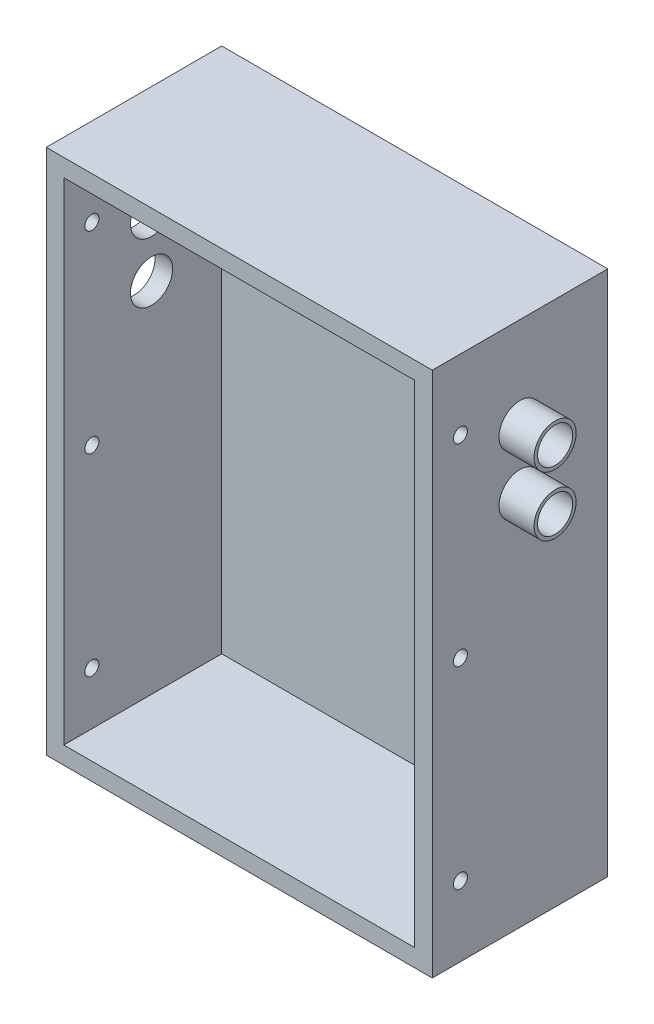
ISO-10303-21;
HEADER;
FILE_DESCRIPTION(('STEP AP214'),'2;1');
FILE_NAME('part.step','',(''),(''),'','','');
FILE_SCHEMA(('AUTOMOTIVE_DESIGN { 1 0 10303 214 1 1 1 1 }'));
ENDSEC;
DATA;
#1=APPLICATION_CONTEXT('core data for automotive mechanical design processes');
#2=APPLICATION_PROTOCOL_DEFINITION('international standard','automotive_design',2000,#1);
#3=PRODUCT_CONTEXT('',#1,'mechanical');
#4=PRODUCT('Part','Part','',(#3));
#5=PRODUCT_RELATED_PRODUCT_CATEGORY('part','',(#4));
#6=PRODUCT_DEFINITION_FORMATION('','',#4);
#7=PRODUCT_DEFINITION_CONTEXT('part definition',#1,'design');
#8=PRODUCT_DEFINITION('design','',#6,#7);
#9=PRODUCT_DEFINITION_SHAPE('','',#8);
#10=(LENGTH_UNIT() NAMED_UNIT(*) SI_UNIT(.MILLI.,.METRE.));
#11=(NAMED_UNIT(*) PLANE_ANGLE_UNIT() SI_UNIT($,.RADIAN.));
#12=(NAMED_UNIT(*) SI_UNIT($,.STERADIAN.) SOLID_ANGLE_UNIT());
#13=UNCERTAINTY_MEASURE_WITH_UNIT(LENGTH_MEASURE(1.E-05),#10,'distance_accuracy_value','');
#14=(GEOMETRIC_REPRESENTATION_CONTEXT(3) GLOBAL_UNCERTAINTY_ASSIGNED_CONTEXT((#13)) GLOBAL_UNIT_ASSIGNED_CONTEXT((#10,
#11,#12)) REPRESENTATION_CONTEXT('',''));
#15=CARTESIAN_POINT('',(0.,0.,0.));
#16=DIRECTION('',(0.,0.,1.));
#17=DIRECTION('',(1.,0.,0.));
#18=AXIS2_PLACEMENT_3D('',#15,#16,#17);
#19=CARTESIAN_POINT('',(-65.000012,32.,25.));
#20=DIRECTION('',(1.,0.,0.));
#21=DIRECTION('',(0.,1.,0.));
#22=AXIS2_PLACEMENT_3D('',#19,#20,#21);
#23=CYLINDRICAL_SURFACE('',#22,5.);
#24=CARTESIAN_POINT('',(64.9999999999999,32.0000000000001,25.));
#25=DIRECTION('',(-1.,0.,0.));
#26=DIRECTION('',(0.,-1.,0.));
#27=AXIS2_PLACEMENT_3D('',#24,#25,#26);
#28=CIRCLE('',#27,5.);
#29=CARTESIAN_POINT('',(64.9999999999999,37.0000000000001,25.));
#30=VERTEX_POINT('',#29);
#31=EDGE_CURVE('E215',#30,#30,#28,.F.);
#32=CARTESIAN_POINT('',(50.,32.0000000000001,25.));
#33=DIRECTION('',(-1.,0.,0.));
#34=DIRECTION('',(0.,-1.,0.));
#35=AXIS2_PLACEMENT_3D('',#32,#33,#34);
#36=CIRCLE('',#35,5.);
#37=CARTESIAN_POINT('',(50.,37.0000000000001,25.));
#38=VERTEX_POINT('',#37);
#39=EDGE_CURVE('E176',#38,#38,#36,.T.);
#40=CARTESIAN_POINT('',(64.9999999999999,37.0000000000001,25.));
#41=CARTESIAN_POINT('',(64.8437499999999,37.0000000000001,25.));
#42=CARTESIAN_POINT('',(64.6875,37.0000000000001,25.));
#43=CARTESIAN_POINT('',(64.3749999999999,37.0000000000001,25.));
#44=CARTESIAN_POINT('',(64.2187499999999,37.0000000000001,25.));
#45=CARTESIAN_POINT('',(63.9062499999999,37.0000000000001,25.));
#46=CARTESIAN_POINT('',(63.7499999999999,37.0000000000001,25.));
#47=CARTESIAN_POINT('',(63.4375,37.0000000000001,25.));
#48=CARTESIAN_POINT('',(63.28125,37.0000000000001,25.));
#49=CARTESIAN_POINT('',(62.96875,37.0000000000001,25.));
#50=CARTESIAN_POINT('',(62.8125,37.0000000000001,25.));
#51=CARTESIAN_POINT('',(62.4999999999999,37.0000000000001,25.));
#52=CARTESIAN_POINT('',(62.34375,37.0000000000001,25.));
#53=CARTESIAN_POINT('',(62.03125,37.0000000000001,25.));
#54=CARTESIAN_POINT('',(61.875,37.0000000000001,25.));
#55=CARTESIAN_POINT('',(61.5625,37.0000000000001,25.));
#56=CARTESIAN_POINT('',(61.40625,37.0000000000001,25.));
#57=CARTESIAN_POINT('',(61.0937499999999,37.0000000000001,25.));
#58=CARTESIAN_POINT('',(60.9375,37.0000000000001,25.));
#59=CARTESIAN_POINT('',(60.625,37.0000000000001,25.));
#60=CARTESIAN_POINT('',(60.46875,37.0000000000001,25.));
#61=CARTESIAN_POINT('',(60.15625,37.0000000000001,25.));
#62=CARTESIAN_POINT('',(60.,37.0000000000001,25.));
#63=CARTESIAN_POINT('',(59.6875,37.0000000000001,25.));
#64=CARTESIAN_POINT('',(59.53125,37.0000000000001,25.));
#65=CARTESIAN_POINT('',(59.21875,37.0000000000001,25.));
#66=CARTESIAN_POINT('',(59.0625,37.0000000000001,25.));
#67=CARTESIAN_POINT('',(58.75,37.0000000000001,25.));
#68=CARTESIAN_POINT('',(58.59375,37.0000000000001,25.));
#69=CARTESIAN_POINT('',(58.28125,37.0000000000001,25.));
#70=CARTESIAN_POINT('',(58.125,37.0000000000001,25.));
#71=CARTESIAN_POINT('',(57.8125,37.0000000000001,25.));
#72=CARTESIAN_POINT('',(57.65625,37.0000000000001,25.));
#73=CARTESIAN_POINT('',(57.34375,37.0000000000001,25.));
#74=CARTESIAN_POINT('',(57.1875,37.0000000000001,25.));
#75=CARTESIAN_POINT('',(56.875,37.0000000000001,25.));
#76=CARTESIAN_POINT('',(56.71875,37.0000000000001,25.));
#77=CARTESIAN_POINT('',(56.40625,37.0000000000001,25.));
#78=CARTESIAN_POINT('',(56.25,37.0000000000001,25.));
#79=CARTESIAN_POINT('',(55.9375,37.0000000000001,25.));
#80=CARTESIAN_POINT('',(55.78125,37.0000000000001,25.));
#81=CARTESIAN_POINT('',(55.46875,37.0000000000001,25.));
#82=CARTESIAN_POINT('',(55.3125,37.0000000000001,25.));
#83=CARTESIAN_POINT('',(55.,37.0000000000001,25.));
#84=CARTESIAN_POINT('',(54.84375,37.0000000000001,25.));
#85=CARTESIAN_POINT('',(54.53125,37.0000000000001,25.));
#86=CARTESIAN_POINT('',(54.375,37.0000000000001,25.));
#87=CARTESIAN_POINT('',(54.0625,37.0000000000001,25.));
#88=CARTESIAN_POINT('',(53.90625,37.0000000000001,25.));
#89=CARTESIAN_POINT('',(53.59375,37.0000000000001,25.));
#90=CARTESIAN_POINT('',(53.4375,37.0000000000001,25.));
#91=CARTESIAN_POINT('',(53.125,37.0000000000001,25.));
#92=CARTESIAN_POINT('',(52.96875,37.0000000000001,25.));
#93=CARTESIAN_POINT('',(52.65625,37.0000000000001,25.));
#94=CARTESIAN_POINT('',(52.5,37.0000000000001,25.));
#95=CARTESIAN_POINT('',(52.1875,37.0000000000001,25.));
#96=CARTESIAN_POINT('',(52.03125,37.0000000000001,25.));
#97=CARTESIAN_POINT('',(51.71875,37.0000000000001,25.));
#98=CARTESIAN_POINT('',(51.5625,37.0000000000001,25.));
#99=CARTESIAN_POINT('',(51.25,37.0000000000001,25.));
#100=CARTESIAN_POINT('',(51.09375,37.0000000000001,25.));
#101=CARTESIAN_POINT('',(50.78125,37.0000000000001,25.));
#102=CARTESIAN_POINT('',(50.625,37.0000000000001,25.));
#103=CARTESIAN_POINT('',(50.3125,37.0000000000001,25.));
#104=CARTESIAN_POINT('',(50.15625,37.0000000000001,25.));
#105=CARTESIAN_POINT('',(50.,37.0000000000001,25.));
#106=B_SPLINE_CURVE_WITH_KNOTS('',3,(#40,#41,#42,#43,#44,#45,#46,#47,#48,#49,#50,#51,#52,#53,
#54,#55,#56,#57,#58,#59,#60,#61,#62,#63,#64,#65,#66,#67,#68,#69,#70,#71,#72,#73,#74,#75,#76,#77,
#78,#79,#80,#81,#82,#83,#84,#85,#86,#87,#88,#89,#90,#91,#92,#93,#94,#95,#96,#97,#98,#99,#100,
#101,#102,#103,#104,#105),.UNSPECIFIED.,.F.,.F.,(4,2,2,2,2,2,2,2,2,2,2,2,2,2,2,2,2,2,2,2,2,2,2,
2,2,2,2,2,2,2,2,2,4),(0.,0.46874999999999,0.937500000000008,1.40625,1.87499999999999,
2.34375000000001,2.8125,3.28124999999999,3.75,4.21874999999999,4.68749999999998,
5.15624999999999,5.62499999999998,6.09374999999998,6.56249999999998,7.03124999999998,
7.49999999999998,7.96874999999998,8.43749999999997,8.90624999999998,9.37499999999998,
9.84374999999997,10.3125,10.78125,11.25,11.71875,12.1875,12.65625,13.125,13.59375,14.0625,
14.53125,15.),.UNSPECIFIED.);
#107=EDGE_CURVE('BSEAM39',#30,#38,#106,.T.);
#108=ORIENTED_EDGE('',*,*,#31,.T.);
#109=ORIENTED_EDGE('',*,*,#39,.T.);
#110=ORIENTED_EDGE('',*,*,#107,.T.);
#111=ORIENTED_EDGE('',*,*,#107,.F.);
#112=EDGE_LOOP('',(#108,#110,#109,#111));
#113=FACE_BOUND('',#112,.T.);
#114=ADVANCED_FACE('F39',(#113),#23,.F.);
#115=CARTESIAN_POINT('',(-65.000012,49.,25.));
#116=DIRECTION('',(1.,0.,0.));
#117=DIRECTION('',(0.,1.,0.));
#118=AXIS2_PLACEMENT_3D('',#115,#116,#117);
#119=CYLINDRICAL_SURFACE('',#118,5.);
#120=CARTESIAN_POINT('',(64.9999999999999,49.,25.));
#121=DIRECTION('',(-1.,0.,0.));
#122=DIRECTION('',(0.,-1.,0.));
#123=AXIS2_PLACEMENT_3D('',#120,#121,#122);
#124=CIRCLE('',#123,5.);
#125=CARTESIAN_POINT('',(64.9999999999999,54.,25.));
#126=VERTEX_POINT('',#125);
#127=EDGE_CURVE('E216',#126,#126,#124,.F.);
#128=CARTESIAN_POINT('',(50.,49.,25.));
#129=DIRECTION('',(-1.,0.,0.));
#130=DIRECTION('',(0.,-1.,0.));
#131=AXIS2_PLACEMENT_3D('',#128,#129,#130);
#132=CIRCLE('',#131,5.);
#133=CARTESIAN_POINT('',(50.,54.,25.));
#134=VERTEX_POINT('',#133);
#135=EDGE_CURVE('E171',#134,#134,#132,.T.);
#136=CARTESIAN_POINT('',(64.9999999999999,54.,25.));
#137=CARTESIAN_POINT('',(64.8437499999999,54.,25.));
#138=CARTESIAN_POINT('',(64.6874999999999,54.,25.));
#139=CARTESIAN_POINT('',(64.3749999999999,54.,25.));
#140=CARTESIAN_POINT('',(64.2187499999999,54.,25.));
#141=CARTESIAN_POINT('',(63.9062499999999,54.,25.));
#142=CARTESIAN_POINT('',(63.7499999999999,54.,25.));
#143=CARTESIAN_POINT('',(63.4374999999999,54.,25.));
#144=CARTESIAN_POINT('',(63.2812499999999,54.,25.));
#145=CARTESIAN_POINT('',(62.9687499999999,54.,25.));
#146=CARTESIAN_POINT('',(62.8124999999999,54.,25.));
#147=CARTESIAN_POINT('',(62.4999999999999,54.,25.));
#148=CARTESIAN_POINT('',(62.3437499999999,54.,25.));
#149=CARTESIAN_POINT('',(62.0312499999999,54.,25.));
#150=CARTESIAN_POINT('',(61.8749999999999,54.,25.));
#151=CARTESIAN_POINT('',(61.5625,54.,25.));
#152=CARTESIAN_POINT('',(61.40625,54.,25.));
#153=CARTESIAN_POINT('',(61.09375,54.,25.));
#154=CARTESIAN_POINT('',(60.9374999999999,54.,25.));
#155=CARTESIAN_POINT('',(60.6249999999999,54.,25.));
#156=CARTESIAN_POINT('',(60.4687499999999,54.,25.));
#157=CARTESIAN_POINT('',(60.15625,54.,25.));
#158=CARTESIAN_POINT('',(60.,54.,25.));
#159=CARTESIAN_POINT('',(59.6875,54.,25.));
#160=CARTESIAN_POINT('',(59.53125,54.,25.));
#161=CARTESIAN_POINT('',(59.21875,54.,25.));
#162=CARTESIAN_POINT('',(59.0625,54.,25.));
#163=CARTESIAN_POINT('',(58.75,54.,25.));
#164=CARTESIAN_POINT('',(58.59375,54.,25.));
#165=CARTESIAN_POINT('',(58.28125,54.,25.));
#166=CARTESIAN_POINT('',(58.125,54.,25.));
#167=CARTESIAN_POINT('',(57.8125,54.,25.));
#168=CARTESIAN_POINT('',(57.65625,54.,25.));
#169=CARTESIAN_POINT('',(57.34375,54.,25.));
#170=CARTESIAN_POINT('',(57.1875,54.,25.));
#171=CARTESIAN_POINT('',(56.875,54.,25.));
#172=CARTESIAN_POINT('',(56.71875,54.,25.));
#173=CARTESIAN_POINT('',(56.40625,54.,25.));
#174=CARTESIAN_POINT('',(56.25,54.,25.));
#175=CARTESIAN_POINT('',(55.9375,54.,25.));
#176=CARTESIAN_POINT('',(55.78125,54.,25.));
#177=CARTESIAN_POINT('',(55.46875,54.,25.));
#178=CARTESIAN_POINT('',(55.3125,54.,25.));
#179=CARTESIAN_POINT('',(55.,54.,25.));
#180=CARTESIAN_POINT('',(54.84375,54.,25.));
#181=CARTESIAN_POINT('',(54.53125,54.,25.));
#182=CARTESIAN_POINT('',(54.375,54.,25.));
#183=CARTESIAN_POINT('',(54.0625,54.,25.));
#184=CARTESIAN_POINT('',(53.90625,54.,25.));
#185=CARTESIAN_POINT('',(53.59375,54.,25.));
#186=CARTESIAN_POINT('',(53.4375,54.,25.));
#187=CARTESIAN_POINT('',(53.125,54.,25.));
#188=CARTESIAN_POINT('',(52.96875,54.,25.));
#189=CARTESIAN_POINT('',(52.65625,54.,25.));
#190=CARTESIAN_POINT('',(52.5,54.,25.));
#191=CARTESIAN_POINT('',(52.1875,54.,25.));
#192=CARTESIAN_POINT('',(52.03125,54.,25.));
#193=CARTESIAN_POINT('',(51.71875,54.,25.));
#194=CARTESIAN_POINT('',(51.5625,54.,25.));
#195=CARTESIAN_POINT('',(51.25,54.,25.));
#196=CARTESIAN_POINT('',(51.09375,54.,25.));
#197=CARTESIAN_POINT('',(50.78125,54.,25.));
#198=CARTESIAN_POINT('',(50.625,54.,25.));
#199=CARTESIAN_POINT('',(50.3125,54.,25.));
#200=CARTESIAN_POINT('',(50.15625,54.,25.));
#201=CARTESIAN_POINT('',(50.,54.,25.));
#202=B_SPLINE_CURVE_WITH_KNOTS('',3,(#136,#137,#138,#139,#140,#141,#142,#143,#144,#145,#146,
#147,#148,#149,#150,#151,#152,#153,#154,#155,#156,#157,#158,#159,#160,#161,#162,#163,#164,#165,
#166,#167,#168,#169,#170,#171,#172,#173,#174,#175,#176,#177,#178,#179,#180,#181,#182,#183,#184,
#185,#186,#187,#188,#189,#190,#191,#192,#193,#194,#195,#196,#197,#198,#199,#200,#201),
.UNSPECIFIED.,.F.,.F.,(4,2,2,2,2,2,2,2,2,2,2,2,2,2,2,2,2,2,2,2,2,2,2,2,2,2,2,2,2,2,2,2,4),(0.,
0.46874999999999,0.937500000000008,1.40625,1.87499999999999,2.34375000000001,2.8125,
3.28124999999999,3.74999999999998,4.21874999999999,4.68749999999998,5.15624999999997,
5.62499999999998,6.09374999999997,6.56249999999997,7.03124999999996,7.49999999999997,
7.96874999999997,8.43749999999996,8.90624999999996,9.37499999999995,9.84374999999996,10.3125,
10.78125,11.25,11.71875,12.1874999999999,12.65625,13.125,13.5937499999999,14.0625,
14.5312499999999,14.9999999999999),.UNSPECIFIED.);
#203=EDGE_CURVE('BSEAM323',#126,#134,#202,.T.);
#204=ORIENTED_EDGE('',*,*,#127,.T.);
#205=ORIENTED_EDGE('',*,*,#135,.T.);
#206=ORIENTED_EDGE('',*,*,#203,.T.);
#207=ORIENTED_EDGE('',*,*,#203,.F.);
#208=EDGE_LOOP('',(#204,#206,#205,#207));
#209=FACE_BOUND('',#208,.T.);
#210=ADVANCED_FACE('F323',(#209),#119,.F.);
#211=CARTESIAN_POINT('',(55.,75.,50.));
#212=DIRECTION('',(-1.,0.,0.));
#213=DIRECTION('',(0.,0.,1.));
#214=AXIS2_PLACEMENT_3D('',#211,#212,#213);
#215=PLANE('',#214);
#216=CARTESIAN_POINT('',(55.,55.,42.));
#217=DIRECTION('',(-1.,0.,0.));
#218=DIRECTION('',(0.,0.,1.));
#219=AXIS2_PLACEMENT_3D('',#216,#217,#218);
#220=CIRCLE('',#219,2.);
#221=CARTESIAN_POINT('',(55.,55.,44.));
#222=VERTEX_POINT('',#221);
#223=EDGE_CURVE('E211',#222,#222,#220,.T.);
#224=ORIENTED_EDGE('',*,*,#223,.T.);
#225=EDGE_LOOP('',(#224));
#226=FACE_BOUND('',#225,.T.);
#227=CARTESIAN_POINT('',(55.,0.,42.));
#228=DIRECTION('',(-1.,0.,0.));
#229=DIRECTION('',(0.,0.,1.));
#230=AXIS2_PLACEMENT_3D('',#227,#228,#229);
#231=CIRCLE('',#230,2.);
#232=CARTESIAN_POINT('',(55.,0.,44.));
#233=VERTEX_POINT('',#232);
#234=EDGE_CURVE('E200',#233,#233,#231,.T.);
#235=ORIENTED_EDGE('',*,*,#234,.T.);
#236=EDGE_LOOP('',(#235));
#237=FACE_BOUND('',#236,.T.);
#238=CARTESIAN_POINT('',(55.,-55.,42.));
#239=DIRECTION('',(-1.,0.,0.));
#240=DIRECTION('',(0.,0.,1.));
#241=AXIS2_PLACEMENT_3D('',#238,#239,#240);
#242=CIRCLE('',#241,2.);
#243=CARTESIAN_POINT('',(55.,-55.,44.));
#244=VERTEX_POINT('',#243);
#245=EDGE_CURVE('E188',#244,#244,#242,.T.);
#246=ORIENTED_EDGE('',*,*,#245,.T.);
#247=EDGE_LOOP('',(#246));
#248=FACE_BOUND('',#247,.T.);
#249=CARTESIAN_POINT('',(55.,32.0000000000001,25.));
#250=DIRECTION('',(-1.,0.,0.));
#251=DIRECTION('',(0.,0.,1.));
#252=AXIS2_PLACEMENT_3D('',#249,#250,#251);
#253=CIRCLE('',#252,6.);
#254=CARTESIAN_POINT('',(55.,32.0000000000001,31.));
#255=VERTEX_POINT('',#254);
#256=EDGE_CURVE('E227',#255,#255,#253,.T.);
#257=ORIENTED_EDGE('',*,*,#256,.T.);
#258=EDGE_LOOP('',(#257));
#259=FACE_BOUND('',#258,.T.);
#260=CARTESIAN_POINT('',(55.,49.,25.));
#261=DIRECTION('',(-1.,0.,0.));
#262=DIRECTION('',(0.,0.,1.));
#263=AXIS2_PLACEMENT_3D('',#260,#261,#262);
#264=CIRCLE('',#263,6.);
#265=CARTESIAN_POINT('',(55.,49.,31.));
#266=VERTEX_POINT('',#265);
#267=EDGE_CURVE('E235',#266,#266,#264,.T.);
#268=ORIENTED_EDGE('',*,*,#267,.T.);
#269=EDGE_LOOP('',(#268));
#270=FACE_BOUND('',#269,.T.);
#271=DIRECTION('',(0.,1.,0.));
#272=VECTOR('',#271,1.);
#273=CARTESIAN_POINT('',(55.,75.,0.));
#274=LINE('',#273,#272);
#275=CARTESIAN_POINT('',(55.,-75.,0.));
#276=VERTEX_POINT('',#275);
#277=CARTESIAN_POINT('',(55.,75.,0.));
#278=VERTEX_POINT('',#277);
#279=EDGE_CURVE('E239',#276,#278,#274,.T.);
#280=ORIENTED_EDGE('',*,*,#279,.T.);
#281=DIRECTION('',(0.,0.,-1.));
#282=VECTOR('',#281,1.);
#283=CARTESIAN_POINT('',(55.,75.,50.));
#284=LINE('',#283,#282);
#285=CARTESIAN_POINT('',(55.,75.,50.));
#286=VERTEX_POINT('',#285);
#287=EDGE_CURVE('E11',#286,#278,#284,.T.);
#288=ORIENTED_EDGE('',*,*,#287,.F.);
#289=DIRECTION('',(0.,1.,0.));
#290=VECTOR('',#289,1.);
#291=CARTESIAN_POINT('',(55.,75.,50.));
#292=LINE('',#291,#290);
#293=CARTESIAN_POINT('',(55.,-75.,50.));
#294=VERTEX_POINT('',#293);
#295=EDGE_CURVE('E240',#294,#286,#292,.T.);
#296=ORIENTED_EDGE('',*,*,#295,.F.);
#297=DIRECTION('',(0.,0.,-1.));
#298=VECTOR('',#297,1.);
#299=CARTESIAN_POINT('',(55.,-75.,50.));
#300=LINE('',#299,#298);
#301=EDGE_CURVE('E250',#294,#276,#300,.T.);
#302=ORIENTED_EDGE('',*,*,#301,.T.);
#303=EDGE_LOOP('',(#280,#288,#296,#302));
#304=FACE_BOUND('',#303,.T.);
#305=ADVANCED_FACE('F41',(#226,#237,#248,#259,#270,#304),#215,.F.);
#306=CARTESIAN_POINT('',(-55.,75.,50.));
#307=DIRECTION('',(0.,-1.,0.));
#308=DIRECTION('',(0.,0.,-1.));
#309=AXIS2_PLACEMENT_3D('',#306,#307,#308);
#310=PLANE('',#309);
#311=DIRECTION('',(0.,0.,-1.));
#312=VECTOR('',#311,1.);
#313=CARTESIAN_POINT('',(-55.,75.,50.));
#314=LINE('',#313,#312);
#315=CARTESIAN_POINT('',(-55.,75.,50.));
#316=VERTEX_POINT('',#315);
#317=CARTESIAN_POINT('',(-55.,75.,0.));
#318=VERTEX_POINT('',#317);
#319=EDGE_CURVE('E49',#316,#318,#314,.T.);
#320=ORIENTED_EDGE('',*,*,#319,.F.);
#321=DIRECTION('',(-1.,0.,0.));
#322=VECTOR('',#321,1.);
#323=CARTESIAN_POINT('',(-55.,75.,50.));
#324=LINE('',#323,#322);
#325=EDGE_CURVE('E94',#286,#316,#324,.T.);
#326=ORIENTED_EDGE('',*,*,#325,.F.);
#327=ORIENTED_EDGE('',*,*,#287,.T.);
#328=DIRECTION('',(-1.,0.,0.));
#329=VECTOR('',#328,1.);
#330=CARTESIAN_POINT('',(-55.,75.,0.));
#331=LINE('',#330,#329);
#332=EDGE_CURVE('E254',#278,#318,#331,.T.);
#333=ORIENTED_EDGE('',*,*,#332,.T.);
#334=EDGE_LOOP('',(#320,#326,#327,#333));
#335=FACE_BOUND('',#334,.T.);
#336=ADVANCED_FACE('F296',(#335),#310,.F.);
#337=CARTESIAN_POINT('',(-55.,75.,50.));
#338=DIRECTION('',(1.,0.,0.));
#339=DIRECTION('',(0.,1.,0.));
#340=AXIS2_PLACEMENT_3D('',#337,#338,#339);
#341=PLANE('',#340);
#342=CARTESIAN_POINT('',(-55.,55.,42.));
#343=DIRECTION('',(1.,0.,0.));
#344=DIRECTION('',(0.,1.,0.));
#345=AXIS2_PLACEMENT_3D('',#342,#343,#344);
#346=CIRCLE('',#345,2.);
#347=CARTESIAN_POINT('',(-55.,57.,42.));
#348=VERTEX_POINT('',#347);
#349=EDGE_CURVE('E204',#348,#348,#346,.T.);
#350=ORIENTED_EDGE('',*,*,#349,.T.);
#351=EDGE_LOOP('',(#350));
#352=FACE_BOUND('',#351,.T.);
#353=CARTESIAN_POINT('',(-55.,0.,42.));
#354=DIRECTION('',(1.,0.,0.));
#355=DIRECTION('',(0.,1.,0.));
#356=AXIS2_PLACEMENT_3D('',#353,#354,#355);
#357=CIRCLE('',#356,2.);
#358=CARTESIAN_POINT('',(-55.,2.00000000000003,42.));
#359=VERTEX_POINT('',#358);
#360=EDGE_CURVE('E193',#359,#359,#357,.T.);
#361=ORIENTED_EDGE('',*,*,#360,.T.);
#362=EDGE_LOOP('',(#361));
#363=FACE_BOUND('',#362,.T.);
#364=CARTESIAN_POINT('',(-55.,-55.,42.));
#365=DIRECTION('',(1.,0.,0.));
#366=DIRECTION('',(0.,1.,0.));
#367=AXIS2_PLACEMENT_3D('',#364,#365,#366);
#368=CIRCLE('',#367,2.);
#369=CARTESIAN_POINT('',(-55.,-53.,42.));
#370=VERTEX_POINT('',#369);
#371=EDGE_CURVE('E184',#370,#370,#368,.T.);
#372=ORIENTED_EDGE('',*,*,#371,.T.);
#373=EDGE_LOOP('',(#372));
#374=FACE_BOUND('',#373,.T.);
#375=CARTESIAN_POINT('',(-55.,32.,25.));
#376=DIRECTION('',(1.,0.,0.));
#377=DIRECTION('',(0.,1.,0.));
#378=AXIS2_PLACEMENT_3D('',#375,#376,#377);
#379=CIRCLE('',#378,6.);
#380=CARTESIAN_POINT('',(-55.,38.,25.));
#381=VERTEX_POINT('',#380);
#382=EDGE_CURVE('E305',#381,#381,#379,.T.);
#383=ORIENTED_EDGE('',*,*,#382,.T.);
#384=EDGE_LOOP('',(#383));
#385=FACE_BOUND('',#384,.T.);
#386=CARTESIAN_POINT('',(-55.,49.,25.));
#387=DIRECTION('',(1.,0.,0.));
#388=DIRECTION('',(0.,1.,0.));
#389=AXIS2_PLACEMENT_3D('',#386,#387,#388);
#390=CIRCLE('',#389,6.);
#391=CARTESIAN_POINT('',(-55.,55.,25.));
#392=VERTEX_POINT('',#391);
#393=EDGE_CURVE('E147',#392,#392,#390,.T.);
#394=ORIENTED_EDGE('',*,*,#393,.T.);
#395=EDGE_LOOP('',(#394));
#396=FACE_BOUND('',#395,.T.);
#397=DIRECTION('',(0.,-1.,0.));
#398=VECTOR('',#397,1.);
#399=CARTESIAN_POINT('',(-55.,75.,0.));
#400=LINE('',#399,#398);
#401=CARTESIAN_POINT('',(-55.,-75.,0.));
#402=VERTEX_POINT('',#401);
#403=EDGE_CURVE('E257',#318,#402,#400,.T.);
#404=ORIENTED_EDGE('',*,*,#403,.T.);
#405=DIRECTION('',(0.,0.,-1.));
#406=VECTOR('',#405,1.);
#407=CARTESIAN_POINT('',(-55.,-75.,50.));
#408=LINE('',#407,#406);
#409=CARTESIAN_POINT('',(-55.,-75.,50.));
#410=VERTEX_POINT('',#409);
#411=EDGE_CURVE('E264',#410,#402,#408,.T.);
#412=ORIENTED_EDGE('',*,*,#411,.F.);
#413=DIRECTION('',(0.,-1.,0.));
#414=VECTOR('',#413,1.);
#415=CARTESIAN_POINT('',(-55.,75.,50.));
#416=LINE('',#415,#414);
#417=EDGE_CURVE('E245',#316,#410,#416,.T.);
#418=ORIENTED_EDGE('',*,*,#417,.F.);
#419=ORIENTED_EDGE('',*,*,#319,.T.);
#420=EDGE_LOOP('',(#404,#412,#418,#419));
#421=FACE_BOUND('',#420,.T.);
#422=ADVANCED_FACE('F292',(#352,#363,#374,#385,#396,#421),#341,.F.);
#423=CARTESIAN_POINT('',(-55.,-75.,50.));
#424=DIRECTION('',(0.,1.,0.));
#425=DIRECTION('',(0.,0.,1.));
#426=AXIS2_PLACEMENT_3D('',#423,#424,#425);
#427=PLANE('',#426);
#428=ORIENTED_EDGE('',*,*,#301,.F.);
#429=DIRECTION('',(1.,0.,0.));
#430=VECTOR('',#429,1.);
#431=CARTESIAN_POINT('',(-55.,-75.,50.));
#432=LINE('',#431,#430);
#433=EDGE_CURVE('E66',#410,#294,#432,.T.);
#434=ORIENTED_EDGE('',*,*,#433,.F.);
#435=ORIENTED_EDGE('',*,*,#411,.T.);
#436=DIRECTION('',(1.,0.,0.));
#437=VECTOR('',#436,1.);
#438=CARTESIAN_POINT('',(-55.,-75.,0.));
#439=LINE('',#438,#437);
#440=EDGE_CURVE('E87',#402,#276,#439,.T.);
#441=ORIENTED_EDGE('',*,*,#440,.T.);
#442=EDGE_LOOP('',(#428,#434,#435,#441));
#443=FACE_BOUND('',#442,.T.);
#444=ADVANCED_FACE('F295',(#443),#427,.F.);
#445=CARTESIAN_POINT('',(0.,0.,50.));
#446=DIRECTION('',(0.,0.,1.));
#447=DIRECTION('',(1.,0.,0.));
#448=AXIS2_PLACEMENT_3D('',#445,#446,#447);
#449=PLANE('',#448);
#450=DIRECTION('',(0.,1.,0.));
#451=VECTOR('',#450,1.);
#452=CARTESIAN_POINT('',(50.,70.,50.));
#453=LINE('',#452,#451);
#454=CARTESIAN_POINT('',(50.,-70.,50.));
#455=VERTEX_POINT('',#454);
#456=CARTESIAN_POINT('',(50.,70.,50.));
#457=VERTEX_POINT('',#456);
#458=EDGE_CURVE('E57',#455,#457,#453,.T.);
#459=ORIENTED_EDGE('',*,*,#458,.F.);
#460=DIRECTION('',(1.,0.,0.));
#461=VECTOR('',#460,1.);
#462=CARTESIAN_POINT('',(-50.,-70.,50.));
#463=LINE('',#462,#461);
#464=CARTESIAN_POINT('',(-50.,-70.,50.));
#465=VERTEX_POINT('',#464);
#466=EDGE_CURVE('E140',#465,#455,#463,.T.);
#467=ORIENTED_EDGE('',*,*,#466,.F.);
#468=DIRECTION('',(0.,-1.,0.));
#469=VECTOR('',#468,1.);
#470=CARTESIAN_POINT('',(-50.,70.,50.));
#471=LINE('',#470,#469);
#472=CARTESIAN_POINT('',(-50.,70.,50.));
#473=VERTEX_POINT('',#472);
#474=EDGE_CURVE('E144',#473,#465,#471,.T.);
#475=ORIENTED_EDGE('',*,*,#474,.F.);
#476=DIRECTION('',(-1.,0.,0.));
#477=VECTOR('',#476,1.);
#478=CARTESIAN_POINT('',(-50.,70.,50.));
#479=LINE('',#478,#477);
#480=EDGE_CURVE('E156',#457,#473,#479,.T.);
#481=ORIENTED_EDGE('',*,*,#480,.F.);
#482=EDGE_LOOP('',(#459,#467,#475,#481));
#483=FACE_BOUND('',#482,.T.);
#484=ORIENTED_EDGE('',*,*,#433,.T.);
#485=ORIENTED_EDGE('',*,*,#295,.T.);
#486=ORIENTED_EDGE('',*,*,#325,.T.);
#487=ORIENTED_EDGE('',*,*,#417,.T.);
#488=EDGE_LOOP('',(#484,#485,#486,#487));
#489=FACE_BOUND('',#488,.T.);
#490=ADVANCED_FACE('F318',(#483,#489),#449,.T.);
#491=CARTESIAN_POINT('',(0.,0.,0.));
#492=DIRECTION('',(0.,0.,1.));
#493=DIRECTION('',(1.,0.,0.));
#494=AXIS2_PLACEMENT_3D('',#491,#492,#493);
#495=PLANE('',#494);
#496=ORIENTED_EDGE('',*,*,#279,.F.);
#497=ORIENTED_EDGE('',*,*,#440,.F.);
#498=ORIENTED_EDGE('',*,*,#403,.F.);
#499=ORIENTED_EDGE('',*,*,#332,.F.);
#500=EDGE_LOOP('',(#496,#497,#498,#499));
#501=FACE_BOUND('',#500,.T.);
#502=ADVANCED_FACE('F314',(#501),#495,.F.);
#503=CARTESIAN_POINT('',(64.9999999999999,49.,25.));
#504=DIRECTION('',(-1.,0.,0.));
#505=DIRECTION('',(0.,-1.,0.));
#506=AXIS2_PLACEMENT_3D('',#503,#504,#505);
#507=CYLINDRICAL_SURFACE('',#506,6.);
#508=CARTESIAN_POINT('',(64.9999999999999,49.,25.));
#509=DIRECTION('',(-1.,0.,0.));
#510=DIRECTION('',(0.,-1.,0.));
#511=AXIS2_PLACEMENT_3D('',#508,#509,#510);
#512=CIRCLE('',#511,6.);
#513=CARTESIAN_POINT('',(64.9999999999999,43.,25.));
#514=VERTEX_POINT('',#513);
#515=EDGE_CURVE('E231',#514,#514,#512,.T.);
#516=ORIENTED_EDGE('',*,*,#515,.T.);
#517=EDGE_LOOP('',(#516));
#518=FACE_BOUND('',#517,.T.);
#519=ORIENTED_EDGE('',*,*,#267,.F.);
#520=EDGE_LOOP('',(#519));
#521=FACE_BOUND('',#520,.T.);
#522=ADVANCED_FACE('F348',(#518,#521),#507,.T.);
#523=CARTESIAN_POINT('',(64.9999999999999,49.,25.));
#524=DIRECTION('',(-1.,0.,0.));
#525=DIRECTION('',(0.,-1.,0.));
#526=AXIS2_PLACEMENT_3D('',#523,#524,#525);
#527=PLANE('',#526);
#528=ORIENTED_EDGE('',*,*,#127,.F.);
#529=EDGE_LOOP('',(#528));
#530=FACE_BOUND('',#529,.T.);
#531=ORIENTED_EDGE('',*,*,#515,.F.);
#532=EDGE_LOOP('',(#531));
#533=FACE_BOUND('',#532,.T.);
#534=ADVANCED_FACE('F344',(#530,#533),#527,.F.);
#535=CARTESIAN_POINT('',(64.9999999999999,32.0000000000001,25.));
#536=DIRECTION('',(-1.,0.,0.));
#537=DIRECTION('',(0.,-1.,0.));
#538=AXIS2_PLACEMENT_3D('',#535,#536,#537);
#539=CYLINDRICAL_SURFACE('',#538,6.);
#540=CARTESIAN_POINT('',(64.9999999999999,32.0000000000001,25.));
#541=DIRECTION('',(-1.,0.,0.));
#542=DIRECTION('',(0.,-1.,0.));
#543=AXIS2_PLACEMENT_3D('',#540,#541,#542);
#544=CIRCLE('',#543,6.);
#545=CARTESIAN_POINT('',(64.9999999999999,26.0000000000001,25.));
#546=VERTEX_POINT('',#545);
#547=EDGE_CURVE('E220',#546,#546,#544,.T.);
#548=ORIENTED_EDGE('',*,*,#547,.T.);
#549=EDGE_LOOP('',(#548));
#550=FACE_BOUND('',#549,.T.);
#551=ORIENTED_EDGE('',*,*,#256,.F.);
#552=EDGE_LOOP('',(#551));
#553=FACE_BOUND('',#552,.T.);
#554=ADVANCED_FACE('F340',(#550,#553),#539,.T.);
#555=CARTESIAN_POINT('',(64.9999999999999,32.0000000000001,25.));
#556=DIRECTION('',(-1.,0.,0.));
#557=DIRECTION('',(0.,-1.,0.));
#558=AXIS2_PLACEMENT_3D('',#555,#556,#557);
#559=PLANE('',#558);
#560=ORIENTED_EDGE('',*,*,#31,.F.);
#561=EDGE_LOOP('',(#560));
#562=FACE_BOUND('',#561,.T.);
#563=ORIENTED_EDGE('',*,*,#547,.F.);
#564=EDGE_LOOP('',(#563));
#565=FACE_BOUND('',#564,.T.);
#566=ADVANCED_FACE('F336',(#562,#565),#559,.F.);
#567=CARTESIAN_POINT('',(65.,-55.,42.));
#568=DIRECTION('',(-1.,0.,0.));
#569=DIRECTION('',(0.,-1.,0.));
#570=AXIS2_PLACEMENT_3D('',#567,#568,#569);
#571=CYLINDRICAL_SURFACE('',#570,2.);
#572=CARTESIAN_POINT('',(-50.,-55.,42.));
#573=DIRECTION('',(-1.,0.,0.));
#574=DIRECTION('',(0.,-1.,0.));
#575=AXIS2_PLACEMENT_3D('',#572,#573,#574);
#576=CIRCLE('',#575,2.);
#577=CARTESIAN_POINT('',(-50.,-57.,42.));
#578=VERTEX_POINT('',#577);
#579=EDGE_CURVE('E165',#578,#578,#576,.T.);
#580=ORIENTED_EDGE('',*,*,#579,.F.);
#581=EDGE_LOOP('',(#580));
#582=FACE_BOUND('',#581,.T.);
#583=ORIENTED_EDGE('',*,*,#371,.F.);
#584=EDGE_LOOP('',(#583));
#585=FACE_BOUND('',#584,.T.);
#586=ADVANCED_FACE('F339',(#582,#585),#571,.F.);
#587=CARTESIAN_POINT('',(65.,0.,42.));
#588=DIRECTION('',(-1.,0.,0.));
#589=DIRECTION('',(0.,-1.,0.));
#590=AXIS2_PLACEMENT_3D('',#587,#588,#589);
#591=CYLINDRICAL_SURFACE('',#590,2.);
#592=CARTESIAN_POINT('',(-50.,0.,42.));
#593=DIRECTION('',(-1.,0.,0.));
#594=DIRECTION('',(0.,-1.,0.));
#595=AXIS2_PLACEMENT_3D('',#592,#593,#594);
#596=CIRCLE('',#595,2.);
#597=CARTESIAN_POINT('',(-50.,-1.99999999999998,42.));
#598=VERTEX_POINT('',#597);
#599=EDGE_CURVE('E272',#598,#598,#596,.T.);
#600=ORIENTED_EDGE('',*,*,#599,.F.);
#601=EDGE_LOOP('',(#600));
#602=FACE_BOUND('',#601,.T.);
#603=ORIENTED_EDGE('',*,*,#360,.F.);
#604=EDGE_LOOP('',(#603));
#605=FACE_BOUND('',#604,.T.);
#606=ADVANCED_FACE('F287',(#602,#605),#591,.F.);
#607=CARTESIAN_POINT('',(64.9999999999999,55.,42.));
#608=DIRECTION('',(-1.,0.,0.));
#609=DIRECTION('',(0.,-1.,0.));
#610=AXIS2_PLACEMENT_3D('',#607,#608,#609);
#611=CYLINDRICAL_SURFACE('',#610,2.);
#612=CARTESIAN_POINT('',(-50.,55.,42.));
#613=DIRECTION('',(-1.,0.,0.));
#614=DIRECTION('',(0.,-1.,0.));
#615=AXIS2_PLACEMENT_3D('',#612,#613,#614);
#616=CIRCLE('',#615,2.);
#617=CARTESIAN_POINT('',(-50.,53.,42.));
#618=VERTEX_POINT('',#617);
#619=EDGE_CURVE('E43',#618,#618,#616,.T.);
#620=ORIENTED_EDGE('',*,*,#619,.F.);
#621=EDGE_LOOP('',(#620));
#622=FACE_BOUND('',#621,.T.);
#623=ORIENTED_EDGE('',*,*,#349,.F.);
#624=EDGE_LOOP('',(#623));
#625=FACE_BOUND('',#624,.T.);
#626=ADVANCED_FACE('F283',(#622,#625),#611,.F.);
#627=CARTESIAN_POINT('',(50.,-55.,42.));
#628=DIRECTION('',(1.,0.,0.));
#629=DIRECTION('',(0.,1.,0.));
#630=AXIS2_PLACEMENT_3D('',#627,#628,#629);
#631=CIRCLE('',#630,2.);
#632=CARTESIAN_POINT('',(50.,-53.,42.));
#633=VERTEX_POINT('',#632);
#634=EDGE_CURVE('E175',#633,#633,#631,.T.);
#635=ORIENTED_EDGE('',*,*,#634,.F.);
#636=EDGE_LOOP('',(#635));
#637=FACE_BOUND('',#636,.T.);
#638=ORIENTED_EDGE('',*,*,#245,.F.);
#639=EDGE_LOOP('',(#638));
#640=FACE_BOUND('',#639,.T.);
#641=ADVANCED_FACE('F286',(#637,#640),#571,.F.);
#642=CARTESIAN_POINT('',(50.,0.,42.));
#643=DIRECTION('',(1.,0.,0.));
#644=DIRECTION('',(0.,1.,0.));
#645=AXIS2_PLACEMENT_3D('',#642,#643,#644);
#646=CIRCLE('',#645,2.);
#647=CARTESIAN_POINT('',(50.,2.00000000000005,42.));
#648=VERTEX_POINT('',#647);
#649=EDGE_CURVE('E183',#648,#648,#646,.T.);
#650=ORIENTED_EDGE('',*,*,#649,.F.);
#651=EDGE_LOOP('',(#650));
#652=FACE_BOUND('',#651,.T.);
#653=ORIENTED_EDGE('',*,*,#234,.F.);
#654=EDGE_LOOP('',(#653));
#655=FACE_BOUND('',#654,.T.);
#656=ADVANCED_FACE('F402',(#652,#655),#591,.F.);
#657=CARTESIAN_POINT('',(50.,55.,42.));
#658=DIRECTION('',(1.,0.,0.));
#659=DIRECTION('',(0.,1.,0.));
#660=AXIS2_PLACEMENT_3D('',#657,#658,#659);
#661=CIRCLE('',#660,2.);
#662=CARTESIAN_POINT('',(50.,57.,42.));
#663=VERTEX_POINT('',#662);
#664=EDGE_CURVE('E189',#663,#663,#661,.T.);
#665=ORIENTED_EDGE('',*,*,#664,.F.);
#666=EDGE_LOOP('',(#665));
#667=FACE_BOUND('',#666,.T.);
#668=ORIENTED_EDGE('',*,*,#223,.F.);
#669=EDGE_LOOP('',(#668));
#670=FACE_BOUND('',#669,.T.);
#671=ADVANCED_FACE('F289',(#667,#670),#611,.F.);
#672=CARTESIAN_POINT('',(50.,70.,5.));
#673=DIRECTION('',(1.,0.,0.));
#674=DIRECTION('',(0.,1.,0.));
#675=AXIS2_PLACEMENT_3D('',#672,#673,#674);
#676=PLANE('',#675);
#677=ORIENTED_EDGE('',*,*,#664,.T.);
#678=EDGE_LOOP('',(#677));
#679=FACE_BOUND('',#678,.T.);
#680=ORIENTED_EDGE('',*,*,#649,.T.);
#681=EDGE_LOOP('',(#680));
#682=FACE_BOUND('',#681,.T.);
#683=ORIENTED_EDGE('',*,*,#634,.T.);
#684=EDGE_LOOP('',(#683));
#685=FACE_BOUND('',#684,.T.);
#686=ORIENTED_EDGE('',*,*,#39,.F.);
#687=EDGE_LOOP('',(#686));
#688=FACE_BOUND('',#687,.T.);
#689=ORIENTED_EDGE('',*,*,#458,.T.);
#690=DIRECTION('',(0.,0.,1.));
#691=VECTOR('',#690,1.);
#692=CARTESIAN_POINT('',(50.,70.,5.));
#693=LINE('',#692,#691);
#694=CARTESIAN_POINT('',(50.,70.,5.));
#695=VERTEX_POINT('',#694);
#696=EDGE_CURVE('E114',#695,#457,#693,.T.);
#697=ORIENTED_EDGE('',*,*,#696,.F.);
#698=DIRECTION('',(0.,1.,0.));
#699=VECTOR('',#698,1.);
#700=CARTESIAN_POINT('',(50.,70.,5.));
#701=LINE('',#700,#699);
#702=CARTESIAN_POINT('',(50.,-70.,5.));
#703=VERTEX_POINT('',#702);
#704=EDGE_CURVE('E119',#703,#695,#701,.T.);
#705=ORIENTED_EDGE('',*,*,#704,.F.);
#706=DIRECTION('',(0.,0.,1.));
#707=VECTOR('',#706,1.);
#708=CARTESIAN_POINT('',(50.,-70.,5.));
#709=LINE('',#708,#707);
#710=EDGE_CURVE('E162',#703,#455,#709,.T.);
#711=ORIENTED_EDGE('',*,*,#710,.T.);
#712=EDGE_LOOP('',(#689,#697,#705,#711));
#713=FACE_BOUND('',#712,.T.);
#714=ORIENTED_EDGE('',*,*,#135,.F.);
#715=EDGE_LOOP('',(#714));
#716=FACE_BOUND('',#715,.T.);
#717=ADVANCED_FACE('F116',(#679,#682,#685,#688,#713,#716),#676,.F.);
#718=CARTESIAN_POINT('',(-50.,70.,5.));
#719=DIRECTION('',(-1.,0.,0.));
#720=DIRECTION('',(0.,-1.,0.));
#721=AXIS2_PLACEMENT_3D('',#718,#719,#720);
#722=PLANE('',#721);
#723=CARTESIAN_POINT('',(-50.,49.,25.));
#724=DIRECTION('',(-1.,0.,0.));
#725=DIRECTION('',(0.,-1.,0.));
#726=AXIS2_PLACEMENT_3D('',#723,#724,#725);
#727=CIRCLE('',#726,6.);
#728=CARTESIAN_POINT('',(-50.,43.,25.));
#729=VERTEX_POINT('',#728);
#730=EDGE_CURVE('E545',#729,#729,#727,.T.);
#731=ORIENTED_EDGE('',*,*,#730,.T.);
#732=EDGE_LOOP('',(#731));
#733=FACE_BOUND('',#732,.T.);
#734=CARTESIAN_POINT('',(-50.,32.,25.));
#735=DIRECTION('',(-1.,0.,0.));
#736=DIRECTION('',(0.,-1.,0.));
#737=AXIS2_PLACEMENT_3D('',#734,#735,#736);
#738=CIRCLE('',#737,6.);
#739=CARTESIAN_POINT('',(-50.,26.,25.));
#740=VERTEX_POINT('',#739);
#741=EDGE_CURVE('E549',#740,#740,#738,.T.);
#742=ORIENTED_EDGE('',*,*,#741,.T.);
#743=EDGE_LOOP('',(#742));
#744=FACE_BOUND('',#743,.T.);
#745=ORIENTED_EDGE('',*,*,#619,.T.);
#746=EDGE_LOOP('',(#745));
#747=FACE_BOUND('',#746,.T.);
#748=ORIENTED_EDGE('',*,*,#599,.T.);
#749=EDGE_LOOP('',(#748));
#750=FACE_BOUND('',#749,.T.);
#751=ORIENTED_EDGE('',*,*,#579,.T.);
#752=EDGE_LOOP('',(#751));
#753=FACE_BOUND('',#752,.T.);
#754=ORIENTED_EDGE('',*,*,#474,.T.);
#755=DIRECTION('',(0.,0.,1.));
#756=VECTOR('',#755,1.);
#757=CARTESIAN_POINT('',(-50.,-70.,5.));
#758=LINE('',#757,#756);
#759=CARTESIAN_POINT('',(-50.,-70.,5.));
#760=VERTEX_POINT('',#759);
#761=EDGE_CURVE('E166',#760,#465,#758,.T.);
#762=ORIENTED_EDGE('',*,*,#761,.F.);
#763=DIRECTION('',(0.,-1.,0.));
#764=VECTOR('',#763,1.);
#765=CARTESIAN_POINT('',(-50.,70.,5.));
#766=LINE('',#765,#764);
#767=CARTESIAN_POINT('',(-50.,70.,5.));
#768=VERTEX_POINT('',#767);
#769=EDGE_CURVE('E135',#768,#760,#766,.T.);
#770=ORIENTED_EDGE('',*,*,#769,.F.);
#771=DIRECTION('',(0.,0.,1.));
#772=VECTOR('',#771,1.);
#773=CARTESIAN_POINT('',(-50.,70.,5.));
#774=LINE('',#773,#772);
#775=EDGE_CURVE('E125',#768,#473,#774,.T.);
#776=ORIENTED_EDGE('',*,*,#775,.T.);
#777=EDGE_LOOP('',(#754,#762,#770,#776));
#778=FACE_BOUND('',#777,.T.);
#779=ADVANCED_FACE('F281',(#733,#744,#747,#750,#753,#778),#722,.F.);
#780=CARTESIAN_POINT('',(-50.,-70.,5.));
#781=DIRECTION('',(0.,-1.,0.));
#782=DIRECTION('',(0.,0.,-1.));
#783=AXIS2_PLACEMENT_3D('',#780,#781,#782);
#784=PLANE('',#783);
#785=ORIENTED_EDGE('',*,*,#466,.T.);
#786=ORIENTED_EDGE('',*,*,#710,.F.);
#787=DIRECTION('',(1.,0.,0.));
#788=VECTOR('',#787,1.);
#789=CARTESIAN_POINT('',(-50.,-70.,5.));
#790=LINE('',#789,#788);
#791=EDGE_CURVE('E126',#760,#703,#790,.T.);
#792=ORIENTED_EDGE('',*,*,#791,.F.);
#793=ORIENTED_EDGE('',*,*,#761,.T.);
#794=EDGE_LOOP('',(#785,#786,#792,#793));
#795=FACE_BOUND('',#794,.T.);
#796=ADVANCED_FACE('F438',(#795),#784,.F.);
#797=CARTESIAN_POINT('',(-50.,70.,5.));
#798=DIRECTION('',(0.,1.,0.));
#799=DIRECTION('',(0.,0.,1.));
#800=AXIS2_PLACEMENT_3D('',#797,#798,#799);
#801=PLANE('',#800);
#802=ORIENTED_EDGE('',*,*,#480,.T.);
#803=ORIENTED_EDGE('',*,*,#775,.F.);
#804=DIRECTION('',(-1.,0.,0.));
#805=VECTOR('',#804,1.);
#806=CARTESIAN_POINT('',(-50.,70.,5.));
#807=LINE('',#806,#805);
#808=EDGE_CURVE('E129',#695,#768,#807,.T.);
#809=ORIENTED_EDGE('',*,*,#808,.F.);
#810=ORIENTED_EDGE('',*,*,#696,.T.);
#811=EDGE_LOOP('',(#802,#803,#809,#810));
#812=FACE_BOUND('',#811,.T.);
#813=ADVANCED_FACE('F130',(#812),#801,.F.);
#814=CARTESIAN_POINT('',(0.,0.,5.));
#815=DIRECTION('',(0.,0.,1.));
#816=DIRECTION('',(1.,0.,0.));
#817=AXIS2_PLACEMENT_3D('',#814,#815,#816);
#818=PLANE('',#817);
#819=ORIENTED_EDGE('',*,*,#704,.T.);
#820=ORIENTED_EDGE('',*,*,#808,.T.);
#821=ORIENTED_EDGE('',*,*,#769,.T.);
#822=ORIENTED_EDGE('',*,*,#791,.T.);
#823=EDGE_LOOP('',(#819,#820,#821,#822));
#824=FACE_BOUND('',#823,.T.);
#825=ADVANCED_FACE('F137',(#824),#818,.T.);
#826=CARTESIAN_POINT('',(-50.,32.,25.));
#827=DIRECTION('',(-1.,0.,0.));
#828=DIRECTION('',(0.,-1.,0.));
#829=AXIS2_PLACEMENT_3D('',#826,#827,#828);
#830=CYLINDRICAL_SURFACE('',#829,6.);
#831=ORIENTED_EDGE('',*,*,#741,.F.);
#832=EDGE_LOOP('',(#831));
#833=FACE_BOUND('',#832,.T.);
#834=ORIENTED_EDGE('',*,*,#382,.F.);
#835=EDGE_LOOP('',(#834));
#836=FACE_BOUND('',#835,.T.);
#837=ADVANCED_FACE('F459',(#833,#836),#830,.F.);
#838=CARTESIAN_POINT('',(-50.,49.,25.));
#839=DIRECTION('',(-1.,0.,0.));
#840=DIRECTION('',(0.,-1.,0.));
#841=AXIS2_PLACEMENT_3D('',#838,#839,#840);
#842=CYLINDRICAL_SURFACE('',#841,6.);
#843=ORIENTED_EDGE('',*,*,#730,.F.);
#844=EDGE_LOOP('',(#843));
#845=FACE_BOUND('',#844,.T.);
#846=ORIENTED_EDGE('',*,*,#393,.F.);
#847=EDGE_LOOP('',(#846));
#848=FACE_BOUND('',#847,.T.);
#849=ADVANCED_FACE('F465',(#845,#848),#842,.F.);
#850=CLOSED_SHELL('',(#114,#210,#305,#336,#422,#444,#490,#502,#522,#534,#554,#566,#586,#606,
#626,#641,#656,#671,#717,#779,#796,#813,#825,#837,#849));
#851=MANIFOLD_SOLID_BREP('B2',#850);
#852=ADVANCED_BREP_SHAPE_REPRESENTATION('',(#18,#851),#14);
#853=SHAPE_DEFINITION_REPRESENTATION(#9,#852);
ENDSEC;
END-ISO-10303-21;
